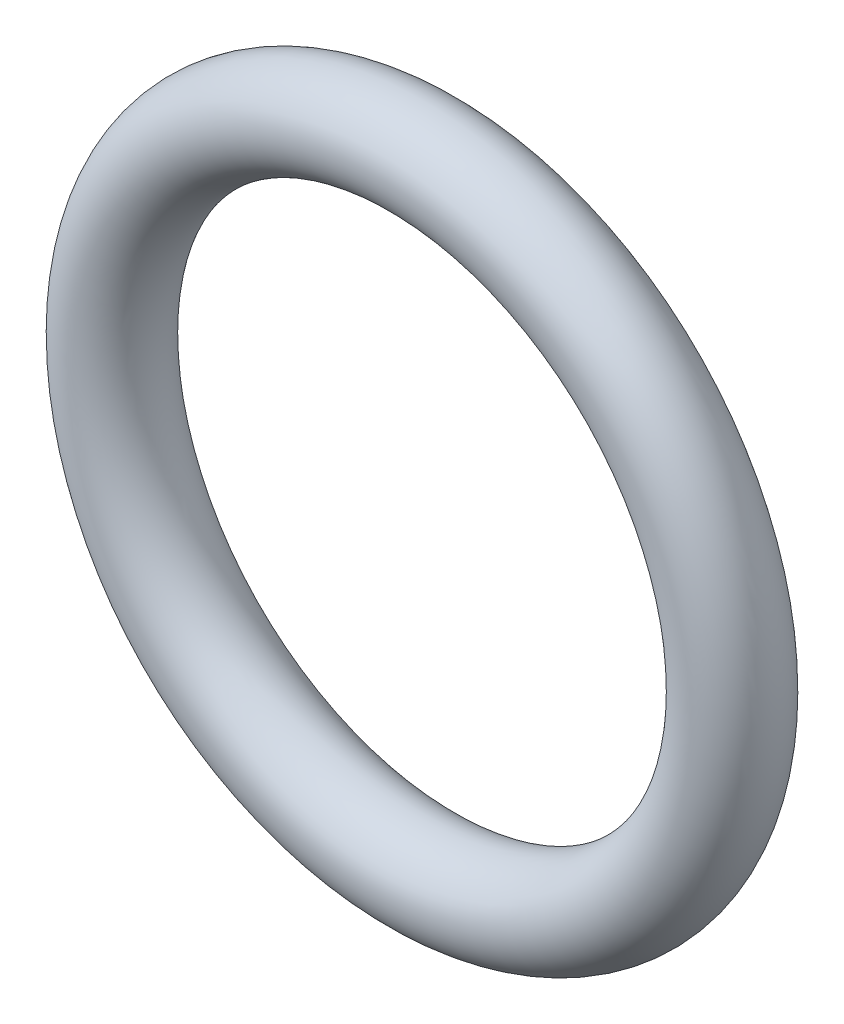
from build123d import *

# Parameters (mm, degrees)
SKETCH_2_R = 0.75


with BuildPart() as part:
    # Sweep 1: sweep along a path in Sketch 1
    with BuildLine(Plane.XY) as sweep_1_path:
        CenterArc((0, 0), 5, 0, 360)
    # Sketch 2 → Sweep 1 (sweep)
    with BuildSketch(Plane(origin=(0, 0, 0), x_dir=(1, 0, 0), z_dir=(0, 1, 0))):
        with Locations((-5, 0)):
            Circle(SKETCH_2_R)
    sweep(path=sweep_1_path.line)


solid = part.part
